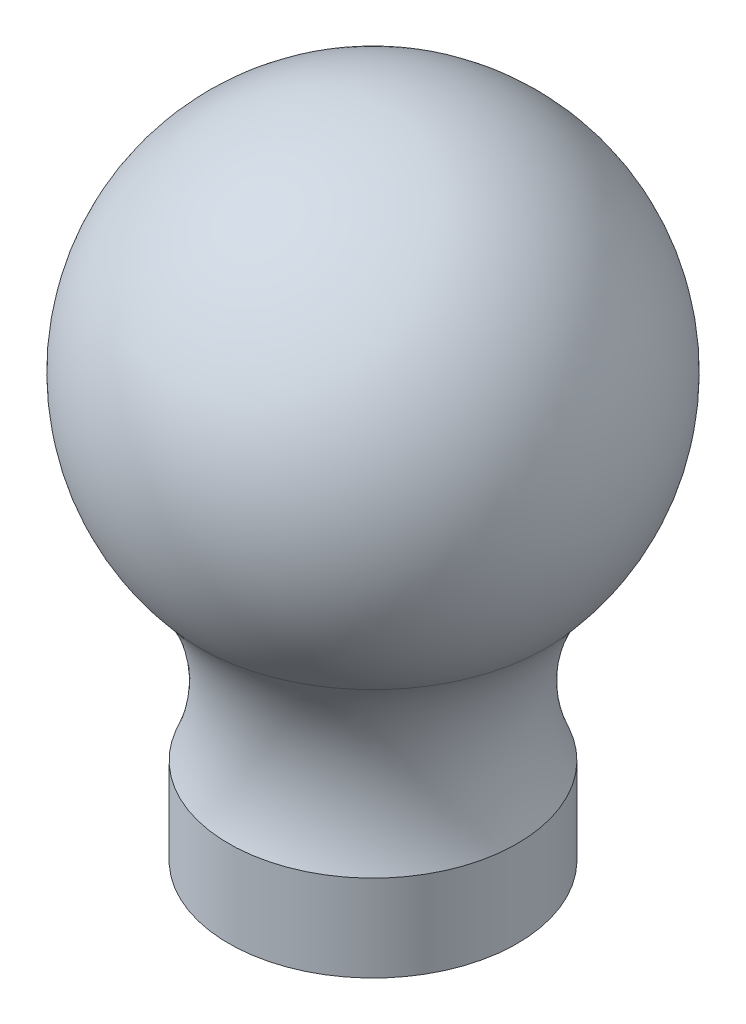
ISO-10303-21;
HEADER;
FILE_DESCRIPTION(('STEP AP214'),'2;1');
FILE_NAME('part.step','',(''),(''),'','','');
FILE_SCHEMA(('AUTOMOTIVE_DESIGN { 1 0 10303 214 1 1 1 1 }'));
ENDSEC;
DATA;
#1=APPLICATION_CONTEXT('core data for automotive mechanical design processes');
#2=APPLICATION_PROTOCOL_DEFINITION('international standard','automotive_design',2000,#1);
#3=PRODUCT_CONTEXT('',#1,'mechanical');
#4=PRODUCT('Part','Part','',(#3));
#5=PRODUCT_RELATED_PRODUCT_CATEGORY('part','',(#4));
#6=PRODUCT_DEFINITION_FORMATION('','',#4);
#7=PRODUCT_DEFINITION_CONTEXT('part definition',#1,'design');
#8=PRODUCT_DEFINITION('design','',#6,#7);
#9=PRODUCT_DEFINITION_SHAPE('','',#8);
#10=(LENGTH_UNIT() NAMED_UNIT(*) SI_UNIT(.MILLI.,.METRE.));
#11=(NAMED_UNIT(*) PLANE_ANGLE_UNIT() SI_UNIT($,.RADIAN.));
#12=(NAMED_UNIT(*) SI_UNIT($,.STERADIAN.) SOLID_ANGLE_UNIT());
#13=UNCERTAINTY_MEASURE_WITH_UNIT(LENGTH_MEASURE(1.E-05),#10,'distance_accuracy_value','');
#14=(GEOMETRIC_REPRESENTATION_CONTEXT(3) GLOBAL_UNCERTAINTY_ASSIGNED_CONTEXT((#13)) GLOBAL_UNIT_ASSIGNED_CONTEXT((#10,
#11,#12)) REPRESENTATION_CONTEXT('',''));
#15=CARTESIAN_POINT('',(0.,0.,0.));
#16=DIRECTION('',(0.,0.,1.));
#17=DIRECTION('',(1.,0.,0.));
#18=AXIS2_PLACEMENT_3D('',#15,#16,#17);
#19=CARTESIAN_POINT('',(0.,0.,0.));
#20=DIRECTION('',(0.,-1.,0.));
#21=DIRECTION('',(0.,0.,-1.));
#22=AXIS2_PLACEMENT_3D('',#19,#20,#21);
#23=PLANE('',#22);
#24=CARTESIAN_POINT('',(0.,0.,0.));
#25=DIRECTION('',(0.,-1.,0.));
#26=DIRECTION('',(0.,0.,-1.));
#27=AXIS2_PLACEMENT_3D('',#24,#25,#26);
#28=CIRCLE('',#27,1.875);
#29=CARTESIAN_POINT('',(0.,0.,-1.875));
#30=VERTEX_POINT('',#29);
#31=EDGE_CURVE('E51',#30,#30,#28,.T.);
#32=ORIENTED_EDGE('',*,*,#31,.F.);
#33=EDGE_LOOP('',(#32));
#34=FACE_BOUND('',#33,.T.);
#35=CARTESIAN_POINT('',(0.,0.,0.));
#36=DIRECTION('',(0.,-1.,0.));
#37=DIRECTION('',(0.,0.,-1.));
#38=AXIS2_PLACEMENT_3D('',#35,#36,#37);
#39=CIRCLE('',#38,5.);
#40=CARTESIAN_POINT('',(0.,0.,-5.));
#41=VERTEX_POINT('',#40);
#42=EDGE_CURVE('E10',#41,#41,#39,.T.);
#43=ORIENTED_EDGE('',*,*,#42,.T.);
#44=EDGE_LOOP('',(#43));
#45=FACE_BOUND('',#44,.T.);
#46=ADVANCED_FACE('F34',(#34,#45),#23,.T.);
#47=CARTESIAN_POINT('',(0.,0.,0.));
#48=DIRECTION('',(0.,-1.,0.));
#49=DIRECTION('',(0.,0.,-1.));
#50=AXIS2_PLACEMENT_3D('',#47,#48,#49);
#51=CYLINDRICAL_SURFACE('',#50,5.);
#52=CARTESIAN_POINT('',(0.,3.,0.));
#53=DIRECTION('',(0.,-1.,0.));
#54=DIRECTION('',(0.,0.,-1.));
#55=AXIS2_PLACEMENT_3D('',#52,#53,#54);
#56=CIRCLE('',#55,5.);
#57=CARTESIAN_POINT('',(0.,3.,-5.));
#58=VERTEX_POINT('',#57);
#59=EDGE_CURVE('E40',#58,#58,#56,.T.);
#60=ORIENTED_EDGE('',*,*,#59,.T.);
#61=EDGE_LOOP('',(#60));
#62=FACE_BOUND('',#61,.T.);
#63=ORIENTED_EDGE('',*,*,#42,.F.);
#64=EDGE_LOOP('',(#63));
#65=FACE_BOUND('',#64,.T.);
#66=ADVANCED_FACE('F67',(#62,#65),#51,.T.);
#67=CARTESIAN_POINT('',(0.,5.39791576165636,0.));
#68=DIRECTION('',(0.,-1.,0.));
#69=DIRECTION('',(0.,0.,-1.));
#70=AXIS2_PLACEMENT_3D('',#67,#68,#69);
#71=TOROIDAL_SURFACE('',#70,10.5,6.);
#72=CARTESIAN_POINT('',(0.,9.36654272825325,0.));
#73=DIRECTION('',(0.,-1.,0.));
#74=DIRECTION('',(0.,0.,-1.));
#75=AXIS2_PLACEMENT_3D('',#72,#73,#74);
#76=CIRCLE('',#75,6.);
#77=CARTESIAN_POINT('',(0.,9.36654272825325,-6.));
#78=VERTEX_POINT('',#77);
#79=EDGE_CURVE('E44',#78,#78,#76,.T.);
#80=ORIENTED_EDGE('',*,*,#79,.T.);
#81=EDGE_LOOP('',(#80));
#82=FACE_BOUND('',#81,.T.);
#83=ORIENTED_EDGE('',*,*,#59,.F.);
#84=EDGE_LOOP('',(#83));
#85=FACE_BOUND('',#84,.T.);
#86=ADVANCED_FACE('F71',(#82,#85),#71,.F.);
#87=CARTESIAN_POINT('',(0.,14.6580453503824,0.));
#88=DIRECTION('',(0.,-1.,0.));
#89=DIRECTION('',(1.,0.,0.));
#90=AXIS2_PLACEMENT_3D('',#87,#88,#89);
#91=SPHERICAL_SURFACE('',#90,8.);
#92=ORIENTED_EDGE('',*,*,#79,.F.);
#93=EDGE_LOOP('',(#92));
#94=FACE_BOUND('',#93,.T.);
#95=ADVANCED_FACE('F62',(#94),#91,.T.);
#96=CARTESIAN_POINT('',(0.,20.,0.));
#97=DIRECTION('',(0.,-1.,0.));
#98=DIRECTION('',(0.,0.,-1.));
#99=AXIS2_PLACEMENT_3D('',#96,#97,#98);
#100=CYLINDRICAL_SURFACE('',#99,1.875);
#101=CARTESIAN_POINT('',(0.,20.,0.));
#102=DIRECTION('',(0.,-1.,0.));
#103=DIRECTION('',(0.,0.,-1.));
#104=AXIS2_PLACEMENT_3D('',#101,#102,#103);
#105=CIRCLE('',#104,1.875);
#106=CARTESIAN_POINT('',(0.,20.,-1.875));
#107=VERTEX_POINT('',#106);
#108=EDGE_CURVE('E48',#107,#107,#105,.T.);
#109=ORIENTED_EDGE('',*,*,#108,.F.);
#110=EDGE_LOOP('',(#109));
#111=FACE_BOUND('',#110,.T.);
#112=ORIENTED_EDGE('',*,*,#31,.T.);
#113=EDGE_LOOP('',(#112));
#114=FACE_BOUND('',#113,.T.);
#115=ADVANCED_FACE('F59',(#111,#114),#100,.F.);
#116=CARTESIAN_POINT('',(0.,20.,0.));
#117=DIRECTION('',(0.,-1.,0.));
#118=DIRECTION('',(0.,0.,-1.));
#119=AXIS2_PLACEMENT_3D('',#116,#117,#118);
#120=PLANE('',#119);
#121=ORIENTED_EDGE('',*,*,#108,.T.);
#122=EDGE_LOOP('',(#121));
#123=FACE_BOUND('',#122,.T.);
#124=ADVANCED_FACE('F57',(#123),#120,.T.);
#125=CLOSED_SHELL('',(#46,#66,#86,#95,#115,#124));
#126=MANIFOLD_SOLID_BREP('B2',#125);
#127=ADVANCED_BREP_SHAPE_REPRESENTATION('',(#18,#126),#14);
#128=SHAPE_DEFINITION_REPRESENTATION(#9,#127);
ENDSEC;
END-ISO-10303-21;
